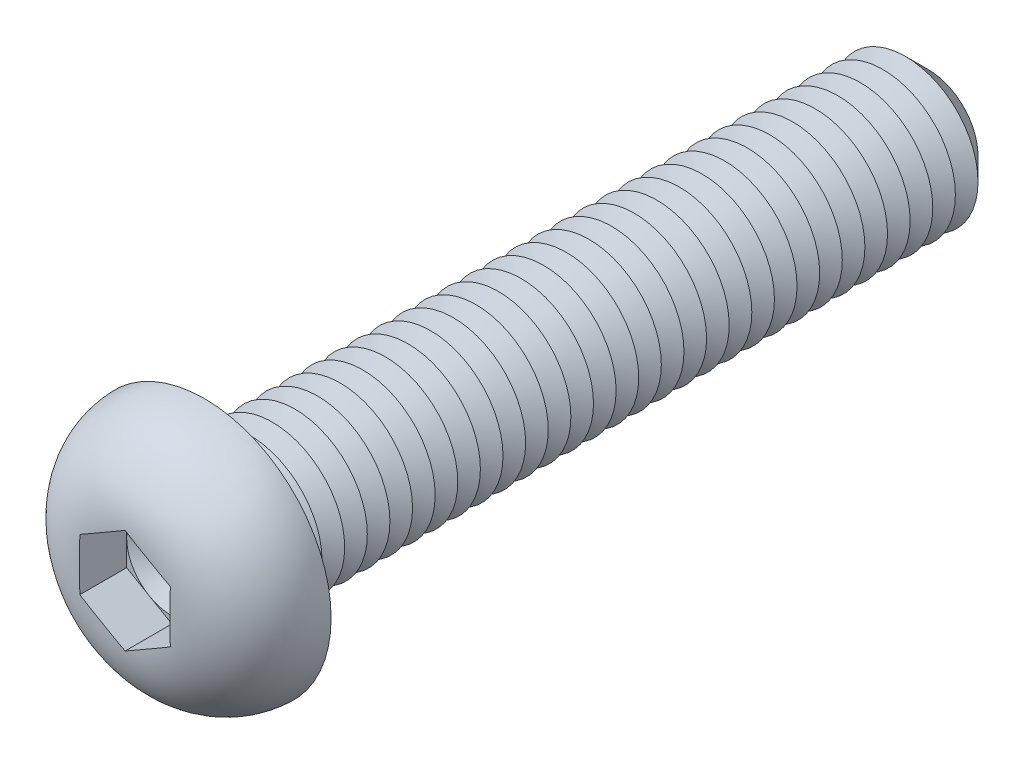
from build123d import *

# Parameters (mm, degrees)
CUT_EXTRUDE1_DEPTH  = 2.6
SKETCH4_R           = 4
BOSS_EXTRUDE1_DEPTH = 40
CHAMFER1_SIZE       = 1.25
LPATTERN1_COUNT     = 30
LPATTERN1_PITCH     = 1.25
FILLET2_R           = 0.5


with BuildPart() as part:
    # Sketch2 → Revolve1 (revolve)
    with BuildSketch(Plane(origin=(0, 0, 0), x_dir=(0, 0, -1), z_dir=(1, 0, 0)), mode=Mode.PRIVATE) as revolve1_sk:
        with BuildLine():
            Line((0, 0), (-4.4, 0))
            Line((-4.4, 0), (-4.4, 2.501111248))
            ThreePointArc((-4.4, 2.501111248), (-3.117141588, 5.647537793), (0, 7))
            Line((0, 7), (0, 0))
        make_face()
    revolve(revolve1_sk.sketch.rotate(Axis((0, 0, 47.934239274), (0, 0, -1)), 90), axis=Axis((0, 0, 47.934239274), (0, 0, -1)))

    # Sketch3 → Cut-Extrude1 (cut)
    with BuildSketch(Plane.XY.offset(4.4)):
        Polygon((0, 2.886751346), (-2.5, 1.443375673), (-2.5, -1.443375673), (0, -2.886751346), (2.5, -1.443375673), (2.5, 1.443375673), align=None)
    extrude(amount=-CUT_EXTRUDE1_DEPTH, mode=Mode.SUBTRACT)

    # Sketch4 → Boss-Extrude1 (add)
    with BuildSketch(Plane(origin=(0, 0, 0), x_dir=(-1, 0, 0), z_dir=(0, 0, -1))):
        with Locations(Location((0, 0, 0), (0, 0, 180))):
            Circle(SKETCH4_R)
    extrude(amount=BOSS_EXTRUDE1_DEPTH)

    # Chamfer1
    chamfer1_edges = [part.edges().sort_by_distance(p)[0] for p in [
        (-4, 0, -40),
    ]]
    chamfer(chamfer1_edges, length=CHAMFER1_SIZE)

    # Sketch5 → Cut-Revolve1 (revolve, cut)
    with BuildSketch(Plane(origin=(0, 0, 0), x_dir=(0, 0, -1), z_dir=(1, 0, 0)), mode=Mode.PRIVATE) as cut_revolve1_sk:
        Polygon((1.25, 4), (2.5, 4), (1.875, 2.917468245), align=None)
    cut_revolve1 = revolve(cut_revolve1_sk.sketch.rotate(Axis((0, 0, 47.934239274), (0, 0, -1)), 90), axis=Axis((0, 0, 47.934239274), (0, 0, -1)), mode=Mode.SUBTRACT)

    # LPattern1: Cut-Revolve1 ×30
    with Locations(*[(0, 0, -i * LPATTERN1_PITCH) for i in range(1, LPATTERN1_COUNT)]):
        add(cut_revolve1, mode=Mode.SUBTRACT)

    # Fillet2
    fillet2_edges = [part.edges().sort_by_distance(p)[0] for p in [
        (-4, 0, 0),
    ]]
    fillet(fillet2_edges, radius=FILLET2_R)

    # Cut-Extrude2 cone 1 section (on through the dimple's axis) → Cut-Extrude2 (revolve, cut)
    with BuildSketch(Plane(origin=(0, 0, 1.8), x_dir=(0, -1, 0), z_dir=(1, 0, 0))):
        Polygon((0, 0), (2.5, 0), (0, 1.443375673), align=None)
    revolve(axis=Axis((0, 0, 1.8), (0, 0, -1)), mode=Mode.SUBTRACT)


solid = part.part
